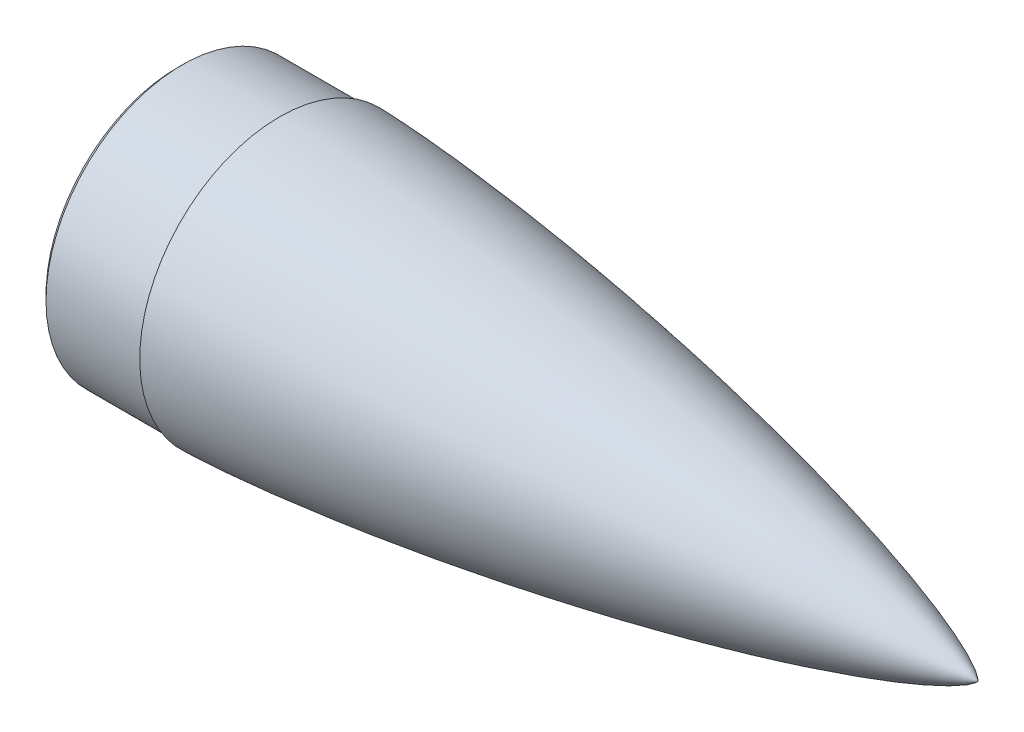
from build123d import *

# Parameters (mm, degrees)
CHAMFER1_SIZE = 3


with BuildPart() as part:
    # Sketch10 → Revolve1 (revolve)
    with BuildSketch(Plane.XY, mode=Mode.PRIVATE) as revolve1_sk:
        with BuildLine():
            Line((10.405784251, 74), (-59.604687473, 74))
            Line((-59.604687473, 74), (-59.604687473, 80))
            Line((-59.604687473, 80), (0.395312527, 80))
            Line((0.395312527, 80), (0.395312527, 82))
            add(Edge.make_bspline(
                [(410, 0), (409.997496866, 0.013472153), (409.990301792, 0.039800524), (409.968165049, 0.090103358), (409.92284863, 0.173127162), (409.855672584, 0.273813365), (409.74938085, 0.412801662), (409.586485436, 0.600066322), (409.327754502, 0.864272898), (408.886911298, 1.261790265), (408.130802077, 1.862436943), (406.802221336, 2.787028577), (404.443171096, 4.219555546), (400.278934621, 6.413492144), (393.395858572, 9.556692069), (381.518163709, 14.280986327), (364.420194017, 20.156175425), (342.917172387, 26.658656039), (318.04643677, 33.376315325), (292.418468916, 39.670772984), (266.676665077, 45.480774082), (240.843900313, 50.869906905), (214.93416181, 55.875628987), (188.957486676, 60.520647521), (166.175141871, 64.278193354), (146.612803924, 67.279856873), (130.288753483, 69.63167706), (117.216602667, 71.421260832), (104.131788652, 73.115855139), (92.671671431, 74.511851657), (82.840989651, 75.642903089), (74.643621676, 76.539402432), (68.082638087, 77.22785357), (61.518564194, 77.886252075), (54.95138814, 78.513039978), (48.381108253, 79.106349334), (41.807700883, 79.663901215), (36.053205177, 80.117977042), (31.118782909, 80.480776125), (27.005411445, 80.763960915), (23.713894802, 80.978298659), (20.097064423, 81.19934178), (16.728563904, 81.388758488), (13.608602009, 81.548588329), (10.737373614, 81.681116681), (8.439959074, 81.777173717), (6.142106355, 81.862551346), (4.131086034, 81.925134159), (2.40706313, 81.969373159), (1.257538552, 81.989729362), (0.68273652, 81.998597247), (0.395312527, 82)],
                knots=[0, 0, 0, 0, 0, 0.000130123, 0.000260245, 0.000520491, 0.000900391, 0.00128029, 0.001925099, 0.002881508, 0.004418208, 0.006927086, 0.011110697, 0.018279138, 0.03067276, 0.051704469, 0.08310228, 0.139908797, 0.202702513, 0.265496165, 0.328289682, 0.391083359, 0.453876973, 0.516670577, 0.579464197, 0.642257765, 0.673654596, 0.705051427, 0.736448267, 0.767845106, 0.799241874, 0.814940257, 0.830638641, 0.846337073, 0.862035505, 0.877733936, 0.893432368, 0.90913072, 0.924829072, 0.932678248, 0.940527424, 0.9483766, 0.956225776, 0.967169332, 0.97264111, 0.978112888, 0.983584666, 0.989056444, 0.994528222, 0.997264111, 1, 1, 1, 1, 1], degree=4))
            Line((410, 0), (370, 0))
            add(Edge.make_bspline(
                [(370, 0), (369.997773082, 0.01229189), (369.991352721, 0.036334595), (369.971541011, 0.082349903), (369.931529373, 0.157248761), (369.872736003, 0.247494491), (369.780094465, 0.371744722), (369.637261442, 0.540398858), (369.408084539, 0.780572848), (369.015670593, 1.143240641), (368.339317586, 1.693244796), (367.151493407, 2.538674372), (365.038483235, 3.850357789), (361.326154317, 5.848779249), (355.237475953, 8.691296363), (344.780745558, 12.948575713), (329.768126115, 18.235928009), (310.906134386, 24.086883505), (289.081904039, 30.136875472), (266.587097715, 35.80912874), (243.987524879, 41.047275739), (221.304119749, 45.907812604), (198.549733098, 50.424041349), (175.733516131, 54.61608253), (155.720574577, 58.008137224), (138.534609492, 60.718410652), (124.192522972, 62.842273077), (112.706913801, 64.458586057), (101.209563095, 65.989281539), (91.139266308, 67.25038835), (82.500410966, 68.272222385), (75.296589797, 69.082186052), (69.530662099, 69.704194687), (63.7618618, 70.299052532), (57.990176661, 70.865336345), (52.215606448, 71.401343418), (46.438127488, 71.904984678), (41.380260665, 72.315076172), (37.043085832, 72.642625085), (33.427512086, 72.898212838), (30.53428839, 73.091559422), (27.378136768, 73.289451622), (23.958792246, 73.486583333), (20.769098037, 73.650713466), (17.809270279, 73.782896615), (15.342091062, 73.877238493), (13.614707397, 73.932869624), (12.13383007, 73.972254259), (11.146418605, 73.990612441), (10.652676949, 73.99862759), (10.405784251, 74)],
                knots=[0, 0, 0, 0, 0, 0.000134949, 0.000269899, 0.000539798, 0.000919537, 0.001299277, 0.001947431, 0.00293136, 0.004511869, 0.007081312, 0.011380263, 0.018707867, 0.031423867, 0.052705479, 0.084103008, 0.140910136, 0.203703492, 0.266497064, 0.329290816, 0.392084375, 0.454877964, 0.517671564, 0.580465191, 0.643258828, 0.674655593, 0.706052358, 0.737449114, 0.768845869, 0.800242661, 0.815941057, 0.831639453, 0.847337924, 0.863036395, 0.878734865, 0.894433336, 0.910131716, 0.925830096, 0.933679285, 0.941528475, 0.949377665, 0.957226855, 0.967920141, 0.978613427, 0.983960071, 0.989306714, 0.994653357, 0.997326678, 1, 1, 1, 1, 1], degree=4))
        make_face()
    revolve(revolve1_sk.sketch.rotate(Axis((46.917858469, 0, 0), (-1, 0, 0)), 90), axis=Axis((46.917858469, 0, 0), (-1, 0, 0)))

    # Chamfer1
    chamfer1_edges = [part.edges().sort_by_distance(p)[0] for p in [
        (-59.604687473, 0, 80),
    ]]
    chamfer(chamfer1_edges, length=CHAMFER1_SIZE)


solid = part.part
